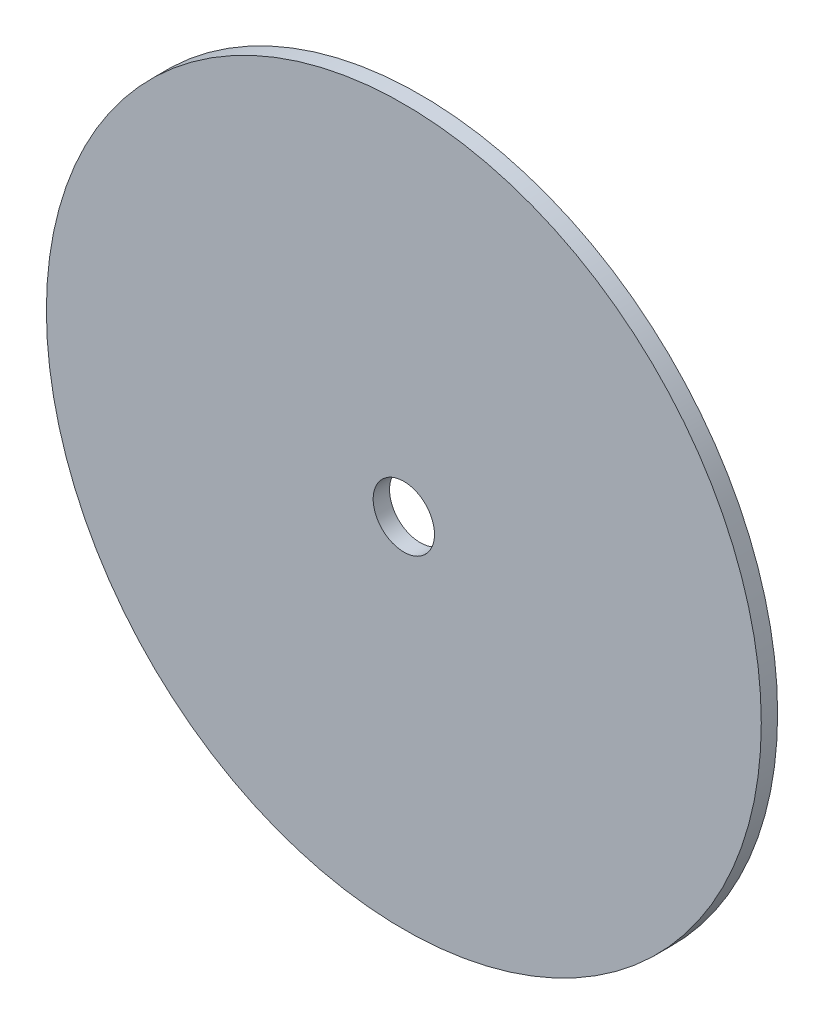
ISO-10303-21;
HEADER;
FILE_DESCRIPTION(('STEP AP214'),'2;1');
FILE_NAME('part.step','',(''),(''),'','','');
FILE_SCHEMA(('AUTOMOTIVE_DESIGN { 1 0 10303 214 1 1 1 1 }'));
ENDSEC;
DATA;
#1=APPLICATION_CONTEXT('core data for automotive mechanical design processes');
#2=APPLICATION_PROTOCOL_DEFINITION('international standard','automotive_design',2000,#1);
#3=PRODUCT_CONTEXT('',#1,'mechanical');
#4=PRODUCT('Part','Part','',(#3));
#5=PRODUCT_RELATED_PRODUCT_CATEGORY('part','',(#4));
#6=PRODUCT_DEFINITION_FORMATION('','',#4);
#7=PRODUCT_DEFINITION_CONTEXT('part definition',#1,'design');
#8=PRODUCT_DEFINITION('design','',#6,#7);
#9=PRODUCT_DEFINITION_SHAPE('','',#8);
#10=(LENGTH_UNIT() NAMED_UNIT(*) SI_UNIT(.MILLI.,.METRE.));
#11=(NAMED_UNIT(*) PLANE_ANGLE_UNIT() SI_UNIT($,.RADIAN.));
#12=(NAMED_UNIT(*) SI_UNIT($,.STERADIAN.) SOLID_ANGLE_UNIT());
#13=UNCERTAINTY_MEASURE_WITH_UNIT(LENGTH_MEASURE(1.E-05),#10,'distance_accuracy_value','');
#14=(GEOMETRIC_REPRESENTATION_CONTEXT(3) GLOBAL_UNCERTAINTY_ASSIGNED_CONTEXT((#13)) GLOBAL_UNIT_ASSIGNED_CONTEXT((#10,
#11,#12)) REPRESENTATION_CONTEXT('',''));
#15=CARTESIAN_POINT('',(0.,0.,0.));
#16=DIRECTION('',(0.,0.,1.));
#17=DIRECTION('',(1.,0.,0.));
#18=AXIS2_PLACEMENT_3D('',#15,#16,#17);
#19=CARTESIAN_POINT('',(0.,0.,8.));
#20=DIRECTION('',(0.,0.,1.));
#21=DIRECTION('',(1.,0.,0.));
#22=AXIS2_PLACEMENT_3D('',#19,#20,#21);
#23=PLANE('',#22);
#24=CARTESIAN_POINT('',(0.,0.,8.));
#25=DIRECTION('',(0.,0.,1.));
#26=DIRECTION('',(1.,0.,0.));
#27=AXIS2_PLACEMENT_3D('',#24,#25,#26);
#28=CIRCLE('',#27,175.);
#29=CARTESIAN_POINT('',(175.,0.,8.));
#30=VERTEX_POINT('',#29);
#31=EDGE_CURVE('E10',#30,#30,#28,.T.);
#32=ORIENTED_EDGE('',*,*,#31,.T.);
#33=EDGE_LOOP('',(#32));
#34=FACE_BOUND('',#33,.T.);
#35=CARTESIAN_POINT('',(0.,0.,8.));
#36=DIRECTION('',(0.,0.,1.));
#37=DIRECTION('',(1.,0.,0.));
#38=AXIS2_PLACEMENT_3D('',#35,#36,#37);
#39=CIRCLE('',#38,15.);
#40=CARTESIAN_POINT('',(15.,0.,8.));
#41=VERTEX_POINT('',#40);
#42=EDGE_CURVE('E54',#41,#41,#39,.T.);
#43=ORIENTED_EDGE('',*,*,#42,.F.);
#44=EDGE_LOOP('',(#43));
#45=FACE_BOUND('',#44,.T.);
#46=ADVANCED_FACE('F41',(#34,#45),#23,.T.);
#47=CARTESIAN_POINT('',(0.,0.,0.));
#48=DIRECTION('',(0.,0.,1.));
#49=DIRECTION('',(1.,0.,0.));
#50=AXIS2_PLACEMENT_3D('',#47,#48,#49);
#51=PLANE('',#50);
#52=CARTESIAN_POINT('',(0.,0.,0.));
#53=DIRECTION('',(0.,0.,1.));
#54=DIRECTION('',(1.,0.,0.));
#55=AXIS2_PLACEMENT_3D('',#52,#53,#54);
#56=CIRCLE('',#55,175.);
#57=CARTESIAN_POINT('',(175.,0.,0.));
#58=VERTEX_POINT('',#57);
#59=EDGE_CURVE('E45',#58,#58,#56,.T.);
#60=ORIENTED_EDGE('',*,*,#59,.F.);
#61=EDGE_LOOP('',(#60));
#62=FACE_BOUND('',#61,.T.);
#63=CARTESIAN_POINT('',(0.,0.,0.));
#64=DIRECTION('',(0.,0.,1.));
#65=DIRECTION('',(1.,0.,0.));
#66=AXIS2_PLACEMENT_3D('',#63,#64,#65);
#67=CIRCLE('',#66,15.);
#68=CARTESIAN_POINT('',(15.,0.,0.));
#69=VERTEX_POINT('',#68);
#70=EDGE_CURVE('E56',#69,#69,#67,.T.);
#71=ORIENTED_EDGE('',*,*,#70,.T.);
#72=EDGE_LOOP('',(#71));
#73=FACE_BOUND('',#72,.T.);
#74=ADVANCED_FACE('F68',(#62,#73),#51,.F.);
#75=CARTESIAN_POINT('',(0.,0.,8.));
#76=DIRECTION('',(0.,0.,-1.));
#77=DIRECTION('',(-1.,0.,0.));
#78=AXIS2_PLACEMENT_3D('',#75,#76,#77);
#79=CYLINDRICAL_SURFACE('',#78,175.);
#80=ORIENTED_EDGE('',*,*,#31,.F.);
#81=EDGE_LOOP('',(#80));
#82=FACE_BOUND('',#81,.T.);
#83=ORIENTED_EDGE('',*,*,#59,.T.);
#84=EDGE_LOOP('',(#83));
#85=FACE_BOUND('',#84,.T.);
#86=ADVANCED_FACE('F43',(#82,#85),#79,.T.);
#87=CARTESIAN_POINT('',(0.,0.,8.));
#88=DIRECTION('',(0.,0.,-1.));
#89=DIRECTION('',(-1.,0.,0.));
#90=AXIS2_PLACEMENT_3D('',#87,#88,#89);
#91=CYLINDRICAL_SURFACE('',#90,15.);
#92=ORIENTED_EDGE('',*,*,#42,.T.);
#93=EDGE_LOOP('',(#92));
#94=FACE_BOUND('',#93,.T.);
#95=ORIENTED_EDGE('',*,*,#70,.F.);
#96=EDGE_LOOP('',(#95));
#97=FACE_BOUND('',#96,.T.);
#98=ADVANCED_FACE('F64',(#94,#97),#91,.F.);
#99=CLOSED_SHELL('',(#46,#74,#86,#98));
#100=MANIFOLD_SOLID_BREP('B2',#99);
#101=ADVANCED_BREP_SHAPE_REPRESENTATION('',(#18,#100),#14);
#102=SHAPE_DEFINITION_REPRESENTATION(#9,#101);
ENDSEC;
END-ISO-10303-21;
